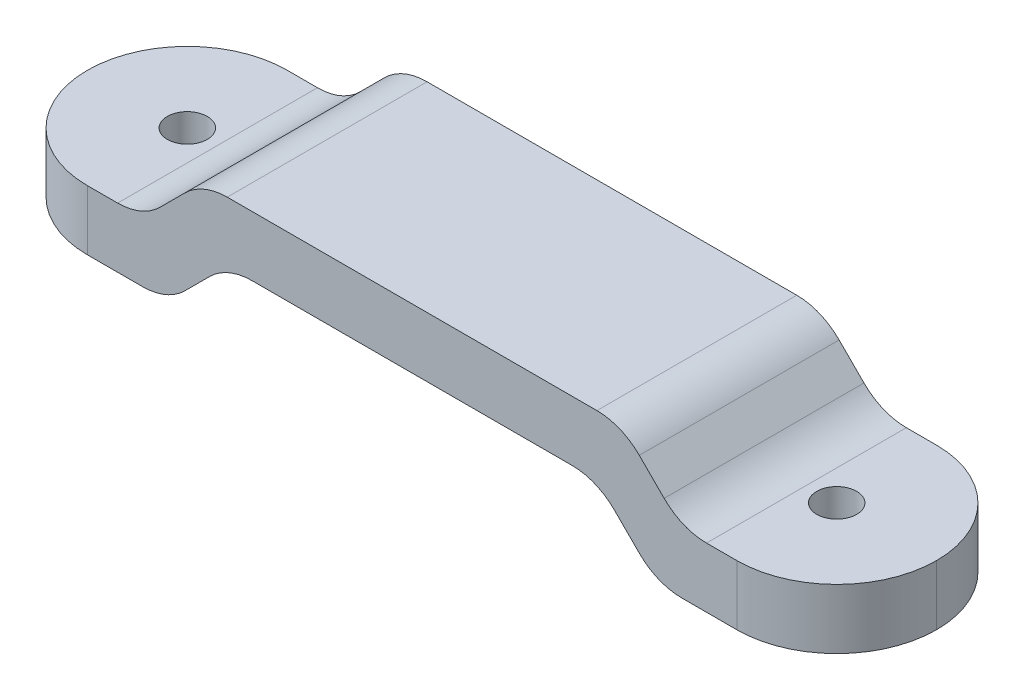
ISO-10303-21;
HEADER;
FILE_DESCRIPTION(('STEP AP214'),'2;1');
FILE_NAME('part.step','',(''),(''),'','','');
FILE_SCHEMA(('AUTOMOTIVE_DESIGN { 1 0 10303 214 1 1 1 1 }'));
ENDSEC;
DATA;
#1=APPLICATION_CONTEXT('core data for automotive mechanical design processes');
#2=APPLICATION_PROTOCOL_DEFINITION('international standard','automotive_design',2000,#1);
#3=PRODUCT_CONTEXT('',#1,'mechanical');
#4=PRODUCT('Part','Part','',(#3));
#5=PRODUCT_RELATED_PRODUCT_CATEGORY('part','',(#4));
#6=PRODUCT_DEFINITION_FORMATION('','',#4);
#7=PRODUCT_DEFINITION_CONTEXT('part definition',#1,'design');
#8=PRODUCT_DEFINITION('design','',#6,#7);
#9=PRODUCT_DEFINITION_SHAPE('','',#8);
#10=(LENGTH_UNIT() NAMED_UNIT(*) SI_UNIT(.MILLI.,.METRE.));
#11=(NAMED_UNIT(*) PLANE_ANGLE_UNIT() SI_UNIT($,.RADIAN.));
#12=(NAMED_UNIT(*) SI_UNIT($,.STERADIAN.) SOLID_ANGLE_UNIT());
#13=UNCERTAINTY_MEASURE_WITH_UNIT(LENGTH_MEASURE(1.E-05),#10,'distance_accuracy_value','');
#14=(GEOMETRIC_REPRESENTATION_CONTEXT(3) GLOBAL_UNCERTAINTY_ASSIGNED_CONTEXT((#13)) GLOBAL_UNIT_ASSIGNED_CONTEXT((#10,
#11,#12)) REPRESENTATION_CONTEXT('',''));
#15=CARTESIAN_POINT('',(0.,0.,0.));
#16=DIRECTION('',(0.,0.,1.));
#17=DIRECTION('',(1.,0.,0.));
#18=AXIS2_PLACEMENT_3D('',#15,#16,#17);
#19=CARTESIAN_POINT('',(-21.25,3.,10.));
#20=DIRECTION('',(0.,-1.,0.));
#21=DIRECTION('',(0.,0.,-1.));
#22=AXIS2_PLACEMENT_3D('',#19,#20,#21);
#23=PLANE('',#22);
#24=CARTESIAN_POINT('',(-16.25,3.,5.));
#25=DIRECTION('',(0.,1.,0.));
#26=DIRECTION('',(0.,0.,1.));
#27=AXIS2_PLACEMENT_3D('',#24,#25,#26);
#28=CIRCLE('',#27,1.);
#29=CARTESIAN_POINT('',(-16.25,3.,6.00000000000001));
#30=VERTEX_POINT('',#29);
#31=EDGE_CURVE('E427',#30,#30,#28,.T.);
#32=ORIENTED_EDGE('',*,*,#31,.F.);
#33=EDGE_LOOP('',(#32));
#34=FACE_BOUND('',#33,.T.);
#35=DIRECTION('',(1.,0.,0.));
#36=VECTOR('',#35,1.);
#37=CARTESIAN_POINT('',(-21.25,3.,0.));
#38=LINE('',#37,#36);
#39=CARTESIAN_POINT('',(-14.7352813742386,3.,0.));
#40=VERTEX_POINT('',#39);
#41=CARTESIAN_POINT('',(-16.25,3.,0.));
#42=VERTEX_POINT('',#41);
#43=EDGE_CURVE('E368',#40,#42,#38,.F.);
#44=ORIENTED_EDGE('',*,*,#43,.T.);
#45=CARTESIAN_POINT('',(-16.25,3.,5.));
#46=DIRECTION('',(0.,-1.,0.));
#47=DIRECTION('',(0.,0.,-1.));
#48=AXIS2_PLACEMENT_3D('',#45,#46,#47);
#49=CIRCLE('',#48,5.);
#50=CARTESIAN_POINT('',(-21.25,3.,5.00000000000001));
#51=VERTEX_POINT('',#50);
#52=EDGE_CURVE('E280',#42,#51,#49,.F.);
#53=ORIENTED_EDGE('',*,*,#52,.T.);
#54=CARTESIAN_POINT('',(-16.25,3.,5.));
#55=DIRECTION('',(0.,-1.,0.));
#56=DIRECTION('',(0.,0.,-1.));
#57=AXIS2_PLACEMENT_3D('',#54,#55,#56);
#58=CIRCLE('',#57,5.);
#59=CARTESIAN_POINT('',(-16.25,3.,10.));
#60=VERTEX_POINT('',#59);
#61=EDGE_CURVE('E278',#51,#60,#58,.F.);
#62=ORIENTED_EDGE('',*,*,#61,.T.);
#63=DIRECTION('',(1.,0.,0.));
#64=VECTOR('',#63,1.);
#65=CARTESIAN_POINT('',(-21.25,3.,10.));
#66=LINE('',#65,#64);
#67=CARTESIAN_POINT('',(-14.7352813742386,3.,10.));
#68=VERTEX_POINT('',#67);
#69=EDGE_CURVE('E335',#68,#60,#66,.F.);
#70=ORIENTED_EDGE('',*,*,#69,.F.);
#71=DIRECTION('',(0.,0.,-1.));
#72=VECTOR('',#71,1.);
#73=CARTESIAN_POINT('',(-14.7352813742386,3.,0.));
#74=LINE('',#73,#72);
#75=EDGE_CURVE('E185',#68,#40,#74,.T.);
#76=ORIENTED_EDGE('',*,*,#75,.T.);
#77=EDGE_LOOP('',(#44,#53,#62,#70,#76));
#78=FACE_BOUND('',#77,.T.);
#79=ADVANCED_FACE('F26',(#34,#78),#23,.F.);
#80=CARTESIAN_POINT('',(-21.25,0.,10.));
#81=DIRECTION('',(0.,-1.,0.));
#82=DIRECTION('',(0.,0.,-1.));
#83=AXIS2_PLACEMENT_3D('',#80,#81,#82);
#84=PLANE('',#83);
#85=CARTESIAN_POINT('',(-16.25,0.,5.));
#86=DIRECTION('',(0.,1.,0.));
#87=DIRECTION('',(0.,0.,1.));
#88=AXIS2_PLACEMENT_3D('',#85,#86,#87);
#89=CIRCLE('',#88,1.);
#90=CARTESIAN_POINT('',(-16.25,0.,6.00000000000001));
#91=VERTEX_POINT('',#90);
#92=EDGE_CURVE('E393',#91,#91,#89,.T.);
#93=ORIENTED_EDGE('',*,*,#92,.T.);
#94=EDGE_LOOP('',(#93));
#95=FACE_BOUND('',#94,.T.);
#96=CARTESIAN_POINT('',(-16.25,0.,5.));
#97=DIRECTION('',(0.,-1.,0.));
#98=DIRECTION('',(0.,0.,-1.));
#99=AXIS2_PLACEMENT_3D('',#96,#97,#98);
#100=CIRCLE('',#99,5.);
#101=CARTESIAN_POINT('',(-16.25,0.,10.));
#102=VERTEX_POINT('',#101);
#103=CARTESIAN_POINT('',(-21.25,0.,5.00000000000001));
#104=VERTEX_POINT('',#103);
#105=EDGE_CURVE('E282',#102,#104,#100,.T.);
#106=ORIENTED_EDGE('',*,*,#105,.T.);
#107=CARTESIAN_POINT('',(-16.25,0.,5.));
#108=DIRECTION('',(0.,-1.,0.));
#109=DIRECTION('',(0.,0.,-1.));
#110=AXIS2_PLACEMENT_3D('',#107,#108,#109);
#111=CIRCLE('',#110,5.);
#112=CARTESIAN_POINT('',(-16.25,0.,0.));
#113=VERTEX_POINT('',#112);
#114=EDGE_CURVE('E284',#104,#113,#111,.T.);
#115=ORIENTED_EDGE('',*,*,#114,.T.);
#116=DIRECTION('',(-1.,0.,0.));
#117=VECTOR('',#116,1.);
#118=CARTESIAN_POINT('',(-21.25,0.,0.));
#119=LINE('',#118,#117);
#120=CARTESIAN_POINT('',(-13.4926406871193,0.,0.));
#121=VERTEX_POINT('',#120);
#122=EDGE_CURVE('E195',#121,#113,#119,.T.);
#123=ORIENTED_EDGE('',*,*,#122,.F.);
#124=DIRECTION('',(0.,0.,-1.));
#125=VECTOR('',#124,1.);
#126=CARTESIAN_POINT('',(-13.4926406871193,0.,10.));
#127=LINE('',#126,#125);
#128=CARTESIAN_POINT('',(-13.4926406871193,0.,10.));
#129=VERTEX_POINT('',#128);
#130=EDGE_CURVE('E215',#121,#129,#127,.F.);
#131=ORIENTED_EDGE('',*,*,#130,.T.);
#132=DIRECTION('',(-1.,0.,0.));
#133=VECTOR('',#132,1.);
#134=CARTESIAN_POINT('',(-21.25,0.,10.));
#135=LINE('',#134,#133);
#136=EDGE_CURVE('E337',#129,#102,#135,.T.);
#137=ORIENTED_EDGE('',*,*,#136,.T.);
#138=EDGE_LOOP('',(#106,#115,#123,#131,#137));
#139=FACE_BOUND('',#138,.T.);
#140=ADVANCED_FACE('F385',(#95,#139),#84,.T.);
#141=CARTESIAN_POINT('',(-12.25,0.,10.));
#142=DIRECTION('',(0.707106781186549,-0.707106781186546,0.));
#143=DIRECTION('',(0.707106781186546,0.707106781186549,0.));
#144=AXIS2_PLACEMENT_3D('',#141,#142,#143);
#145=PLANE('',#144);
#146=DIRECTION('',(-0.707106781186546,-0.707106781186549,0.));
#147=VECTOR('',#146,1.);
#148=CARTESIAN_POINT('',(-12.25,0.,10.));
#149=LINE('',#148,#147);
#150=CARTESIAN_POINT('',(-10.1286796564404,2.12132034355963,10.));
#151=VERTEX_POINT('',#150);
#152=CARTESIAN_POINT('',(-11.3713203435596,0.878679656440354,10.));
#153=VERTEX_POINT('',#152);
#154=EDGE_CURVE('E340',#151,#153,#149,.T.);
#155=ORIENTED_EDGE('',*,*,#154,.T.);
#156=DIRECTION('',(0.,0.,-1.));
#157=VECTOR('',#156,1.);
#158=CARTESIAN_POINT('',(-11.3713203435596,0.878679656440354,10.));
#159=LINE('',#158,#157);
#160=CARTESIAN_POINT('',(-11.3713203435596,0.878679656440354,0.));
#161=VERTEX_POINT('',#160);
#162=EDGE_CURVE('E194',#153,#161,#159,.T.);
#163=ORIENTED_EDGE('',*,*,#162,.T.);
#164=DIRECTION('',(-0.707106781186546,-0.707106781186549,0.));
#165=VECTOR('',#164,1.);
#166=CARTESIAN_POINT('',(-12.25,0.,0.));
#167=LINE('',#166,#165);
#168=CARTESIAN_POINT('',(-10.1286796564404,2.12132034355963,0.));
#169=VERTEX_POINT('',#168);
#170=EDGE_CURVE('E177',#169,#161,#167,.T.);
#171=ORIENTED_EDGE('',*,*,#170,.F.);
#172=DIRECTION('',(0.,0.,-1.));
#173=VECTOR('',#172,1.);
#174=CARTESIAN_POINT('',(-10.1286796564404,2.12132034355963,10.));
#175=LINE('',#174,#173);
#176=EDGE_CURVE('E191',#169,#151,#175,.F.);
#177=ORIENTED_EDGE('',*,*,#176,.T.);
#178=EDGE_LOOP('',(#155,#163,#171,#177));
#179=FACE_BOUND('',#178,.T.);
#180=ADVANCED_FACE('F190',(#179),#145,.T.);
#181=CARTESIAN_POINT('',(-9.25000000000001,3.,10.));
#182=DIRECTION('',(0.,-1.,0.));
#183=DIRECTION('',(1.,0.,0.));
#184=AXIS2_PLACEMENT_3D('',#181,#182,#183);
#185=PLANE('',#184);
#186=DIRECTION('',(-1.,0.,0.));
#187=VECTOR('',#186,1.);
#188=CARTESIAN_POINT('',(-9.25000000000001,3.,10.));
#189=LINE('',#188,#187);
#190=CARTESIAN_POINT('',(8.00735931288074,3.,10.));
#191=VERTEX_POINT('',#190);
#192=CARTESIAN_POINT('',(-8.00735931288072,3.,10.));
#193=VERTEX_POINT('',#192);
#194=EDGE_CURVE('E342',#191,#193,#189,.T.);
#195=ORIENTED_EDGE('',*,*,#194,.T.);
#196=DIRECTION('',(0.,0.,-1.));
#197=VECTOR('',#196,1.);
#198=CARTESIAN_POINT('',(-8.00735931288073,3.,0.));
#199=LINE('',#198,#197);
#200=CARTESIAN_POINT('',(-8.00735931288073,3.,0.));
#201=VERTEX_POINT('',#200);
#202=EDGE_CURVE('E228',#193,#201,#199,.T.);
#203=ORIENTED_EDGE('',*,*,#202,.T.);
#204=DIRECTION('',(-1.,0.,0.));
#205=VECTOR('',#204,1.);
#206=CARTESIAN_POINT('',(-9.25000000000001,3.,0.));
#207=LINE('',#206,#205);
#208=CARTESIAN_POINT('',(8.00735931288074,3.,0.));
#209=VERTEX_POINT('',#208);
#210=EDGE_CURVE('E179',#209,#201,#207,.T.);
#211=ORIENTED_EDGE('',*,*,#210,.F.);
#212=DIRECTION('',(0.,0.,-1.));
#213=VECTOR('',#212,1.);
#214=CARTESIAN_POINT('',(8.00735931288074,3.,10.));
#215=LINE('',#214,#213);
#216=EDGE_CURVE('E226',#209,#191,#215,.F.);
#217=ORIENTED_EDGE('',*,*,#216,.T.);
#218=EDGE_LOOP('',(#195,#203,#211,#217));
#219=FACE_BOUND('',#218,.T.);
#220=ADVANCED_FACE('F491',(#219),#185,.T.);
#221=CARTESIAN_POINT('',(12.25,0.,10.));
#222=DIRECTION('',(-0.707106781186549,-0.707106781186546,0.));
#223=DIRECTION('',(0.707106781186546,-0.707106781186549,0.));
#224=AXIS2_PLACEMENT_3D('',#221,#222,#223);
#225=PLANE('',#224);
#226=DIRECTION('',(-0.707106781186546,0.707106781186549,0.));
#227=VECTOR('',#226,1.);
#228=CARTESIAN_POINT('',(12.25,0.,10.));
#229=LINE('',#228,#227);
#230=CARTESIAN_POINT('',(11.3713203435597,0.878679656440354,10.));
#231=VERTEX_POINT('',#230);
#232=CARTESIAN_POINT('',(10.1286796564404,2.12132034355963,10.));
#233=VERTEX_POINT('',#232);
#234=EDGE_CURVE('E305',#231,#233,#229,.T.);
#235=ORIENTED_EDGE('',*,*,#234,.T.);
#236=DIRECTION('',(0.,0.,-1.));
#237=VECTOR('',#236,1.);
#238=CARTESIAN_POINT('',(10.1286796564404,2.12132034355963,0.));
#239=LINE('',#238,#237);
#240=CARTESIAN_POINT('',(10.1286796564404,2.12132034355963,0.));
#241=VERTEX_POINT('',#240);
#242=EDGE_CURVE('E232',#233,#241,#239,.T.);
#243=ORIENTED_EDGE('',*,*,#242,.T.);
#244=DIRECTION('',(-0.707106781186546,0.707106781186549,0.));
#245=VECTOR('',#244,1.);
#246=CARTESIAN_POINT('',(12.25,0.,0.));
#247=LINE('',#246,#245);
#248=CARTESIAN_POINT('',(11.3713203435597,0.878679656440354,0.));
#249=VERTEX_POINT('',#248);
#250=EDGE_CURVE('E326',#249,#241,#247,.T.);
#251=ORIENTED_EDGE('',*,*,#250,.F.);
#252=DIRECTION('',(0.,0.,-1.));
#253=VECTOR('',#252,1.);
#254=CARTESIAN_POINT('',(11.3713203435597,0.878679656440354,10.));
#255=LINE('',#254,#253);
#256=EDGE_CURVE('E230',#249,#231,#255,.F.);
#257=ORIENTED_EDGE('',*,*,#256,.T.);
#258=EDGE_LOOP('',(#235,#243,#251,#257));
#259=FACE_BOUND('',#258,.T.);
#260=ADVANCED_FACE('F402',(#259),#225,.T.);
#261=CARTESIAN_POINT('',(21.25,0.,9.99999999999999));
#262=DIRECTION('',(0.,-1.,0.));
#263=DIRECTION('',(1.,0.,0.));
#264=AXIS2_PLACEMENT_3D('',#261,#262,#263);
#265=PLANE('',#264);
#266=CARTESIAN_POINT('',(16.25,0.,4.99999999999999));
#267=DIRECTION('',(0.,1.,0.));
#268=DIRECTION('',(0.,0.,-1.));
#269=AXIS2_PLACEMENT_3D('',#266,#267,#268);
#270=CIRCLE('',#269,0.999999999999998);
#271=CARTESIAN_POINT('',(16.25,0.,4.));
#272=VERTEX_POINT('',#271);
#273=EDGE_CURVE('E429',#272,#272,#270,.T.);
#274=ORIENTED_EDGE('',*,*,#273,.T.);
#275=EDGE_LOOP('',(#274));
#276=FACE_BOUND('',#275,.T.);
#277=DIRECTION('',(-1.,0.,0.));
#278=VECTOR('',#277,1.);
#279=CARTESIAN_POINT('',(21.25,0.,0.));
#280=LINE('',#279,#278);
#281=CARTESIAN_POINT('',(16.25,0.,0.));
#282=VERTEX_POINT('',#281);
#283=CARTESIAN_POINT('',(13.4926406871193,0.,0.));
#284=VERTEX_POINT('',#283);
#285=EDGE_CURVE('E321',#282,#284,#280,.T.);
#286=ORIENTED_EDGE('',*,*,#285,.F.);
#287=CARTESIAN_POINT('',(16.25,0.,5.));
#288=DIRECTION('',(0.,-1.,0.));
#289=DIRECTION('',(1.,0.,0.));
#290=AXIS2_PLACEMENT_3D('',#287,#288,#289);
#291=CIRCLE('',#290,5.);
#292=CARTESIAN_POINT('',(21.25,0.,5.00000000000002));
#293=VERTEX_POINT('',#292);
#294=EDGE_CURVE('E46',#282,#293,#291,.T.);
#295=ORIENTED_EDGE('',*,*,#294,.T.);
#296=CARTESIAN_POINT('',(16.25,0.,5.));
#297=DIRECTION('',(0.,-1.,0.));
#298=DIRECTION('',(1.,0.,0.));
#299=AXIS2_PLACEMENT_3D('',#296,#297,#298);
#300=CIRCLE('',#299,5.);
#301=CARTESIAN_POINT('',(16.25,0.,10.));
#302=VERTEX_POINT('',#301);
#303=EDGE_CURVE('E290',#293,#302,#300,.T.);
#304=ORIENTED_EDGE('',*,*,#303,.T.);
#305=DIRECTION('',(-1.,0.,0.));
#306=VECTOR('',#305,1.);
#307=CARTESIAN_POINT('',(21.25,0.,9.99999999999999));
#308=LINE('',#307,#306);
#309=CARTESIAN_POINT('',(13.4926406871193,0.,10.));
#310=VERTEX_POINT('',#309);
#311=EDGE_CURVE('E294',#302,#310,#308,.T.);
#312=ORIENTED_EDGE('',*,*,#311,.T.);
#313=DIRECTION('',(0.,0.,-1.));
#314=VECTOR('',#313,1.);
#315=CARTESIAN_POINT('',(13.4926406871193,0.,10.));
#316=LINE('',#315,#314);
#317=EDGE_CURVE('E235',#310,#284,#316,.T.);
#318=ORIENTED_EDGE('',*,*,#317,.T.);
#319=EDGE_LOOP('',(#286,#295,#304,#312,#318));
#320=FACE_BOUND('',#319,.T.);
#321=ADVANCED_FACE('F293',(#276,#320),#265,.T.);
#322=CARTESIAN_POINT('',(21.25,3.,9.99999999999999));
#323=DIRECTION('',(0.,-1.,0.));
#324=DIRECTION('',(1.,0.,0.));
#325=AXIS2_PLACEMENT_3D('',#322,#323,#324);
#326=PLANE('',#325);
#327=CARTESIAN_POINT('',(16.25,3.,4.99999999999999));
#328=DIRECTION('',(0.,1.,0.));
#329=DIRECTION('',(0.,0.,-1.));
#330=AXIS2_PLACEMENT_3D('',#327,#328,#329);
#331=CIRCLE('',#330,0.999999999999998);
#332=CARTESIAN_POINT('',(16.25,3.,4.));
#333=VERTEX_POINT('',#332);
#334=EDGE_CURVE('E433',#333,#333,#331,.T.);
#335=ORIENTED_EDGE('',*,*,#334,.F.);
#336=EDGE_LOOP('',(#335));
#337=FACE_BOUND('',#336,.T.);
#338=CARTESIAN_POINT('',(16.25,3.,5.));
#339=DIRECTION('',(0.,-1.,0.));
#340=DIRECTION('',(1.,0.,0.));
#341=AXIS2_PLACEMENT_3D('',#338,#339,#340);
#342=CIRCLE('',#341,5.);
#343=CARTESIAN_POINT('',(16.25,3.,10.));
#344=VERTEX_POINT('',#343);
#345=CARTESIAN_POINT('',(21.25,3.,5.00000000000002));
#346=VERTEX_POINT('',#345);
#347=EDGE_CURVE('E33',#344,#346,#342,.F.);
#348=ORIENTED_EDGE('',*,*,#347,.T.);
#349=CARTESIAN_POINT('',(16.25,3.,5.));
#350=DIRECTION('',(0.,-1.,0.));
#351=DIRECTION('',(1.,0.,0.));
#352=AXIS2_PLACEMENT_3D('',#349,#350,#351);
#353=CIRCLE('',#352,5.);
#354=CARTESIAN_POINT('',(16.25,3.,0.));
#355=VERTEX_POINT('',#354);
#356=EDGE_CURVE('E11',#346,#355,#353,.F.);
#357=ORIENTED_EDGE('',*,*,#356,.T.);
#358=DIRECTION('',(-1.,0.,0.));
#359=VECTOR('',#358,1.);
#360=CARTESIAN_POINT('',(21.25,3.,0.));
#361=LINE('',#360,#359);
#362=CARTESIAN_POINT('',(14.7352813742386,3.,0.));
#363=VERTEX_POINT('',#362);
#364=EDGE_CURVE('E317',#355,#363,#361,.T.);
#365=ORIENTED_EDGE('',*,*,#364,.T.);
#366=DIRECTION('',(0.,0.,-1.));
#367=VECTOR('',#366,1.);
#368=CARTESIAN_POINT('',(14.7352813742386,3.,10.));
#369=LINE('',#368,#367);
#370=CARTESIAN_POINT('',(14.7352813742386,3.,10.));
#371=VERTEX_POINT('',#370);
#372=EDGE_CURVE('E248',#363,#371,#369,.F.);
#373=ORIENTED_EDGE('',*,*,#372,.T.);
#374=DIRECTION('',(-1.,0.,0.));
#375=VECTOR('',#374,1.);
#376=CARTESIAN_POINT('',(21.25,3.,9.99999999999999));
#377=LINE('',#376,#375);
#378=EDGE_CURVE('E304',#344,#371,#377,.T.);
#379=ORIENTED_EDGE('',*,*,#378,.F.);
#380=EDGE_LOOP('',(#348,#357,#365,#373,#379));
#381=FACE_BOUND('',#380,.T.);
#382=ADVANCED_FACE('F316',(#337,#381),#326,.F.);
#383=CARTESIAN_POINT('',(14.3713203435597,2.12132034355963,10.));
#384=DIRECTION('',(-0.707106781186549,-0.707106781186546,0.));
#385=DIRECTION('',(0.707106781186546,-0.707106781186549,0.));
#386=AXIS2_PLACEMENT_3D('',#383,#384,#385);
#387=PLANE('',#386);
#388=DIRECTION('',(-0.707106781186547,0.707106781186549,0.));
#389=VECTOR('',#388,1.);
#390=CARTESIAN_POINT('',(14.3713203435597,2.12132034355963,0.));
#391=LINE('',#390,#389);
#392=CARTESIAN_POINT('',(12.6139610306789,3.87867965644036,0.));
#393=VERTEX_POINT('',#392);
#394=CARTESIAN_POINT('',(11.3713203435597,5.12132034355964,0.));
#395=VERTEX_POINT('',#394);
#396=EDGE_CURVE('E320',#393,#395,#391,.T.);
#397=ORIENTED_EDGE('',*,*,#396,.T.);
#398=DIRECTION('',(0.,0.,-1.));
#399=VECTOR('',#398,1.);
#400=CARTESIAN_POINT('',(11.3713203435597,5.12132034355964,10.));
#401=LINE('',#400,#399);
#402=CARTESIAN_POINT('',(11.3713203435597,5.12132034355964,10.));
#403=VERTEX_POINT('',#402);
#404=EDGE_CURVE('E246',#395,#403,#401,.F.);
#405=ORIENTED_EDGE('',*,*,#404,.T.);
#406=DIRECTION('',(-0.707106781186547,0.707106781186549,0.));
#407=VECTOR('',#406,1.);
#408=CARTESIAN_POINT('',(14.3713203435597,2.12132034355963,10.));
#409=LINE('',#408,#407);
#410=CARTESIAN_POINT('',(12.6139610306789,3.87867965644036,10.));
#411=VERTEX_POINT('',#410);
#412=EDGE_CURVE('E348',#411,#403,#409,.T.);
#413=ORIENTED_EDGE('',*,*,#412,.F.);
#414=DIRECTION('',(0.,0.,-1.));
#415=VECTOR('',#414,1.);
#416=CARTESIAN_POINT('',(12.6139610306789,3.87867965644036,0.));
#417=LINE('',#416,#415);
#418=EDGE_CURVE('E243',#411,#393,#417,.T.);
#419=ORIENTED_EDGE('',*,*,#418,.T.);
#420=EDGE_LOOP('',(#397,#405,#413,#419));
#421=FACE_BOUND('',#420,.T.);
#422=ADVANCED_FACE('F470',(#421),#387,.F.);
#423=CARTESIAN_POINT('',(-9.25000000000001,6.,10.));
#424=DIRECTION('',(0.,-1.,0.));
#425=DIRECTION('',(1.,0.,0.));
#426=AXIS2_PLACEMENT_3D('',#423,#424,#425);
#427=PLANE('',#426);
#428=DIRECTION('',(-1.,0.,0.));
#429=VECTOR('',#428,1.);
#430=CARTESIAN_POINT('',(-9.25000000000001,6.,10.));
#431=LINE('',#430,#429);
#432=CARTESIAN_POINT('',(9.25000000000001,6.,10.));
#433=VERTEX_POINT('',#432);
#434=CARTESIAN_POINT('',(-9.25000000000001,6.,10.));
#435=VERTEX_POINT('',#434);
#436=EDGE_CURVE('E204',#433,#435,#431,.T.);
#437=ORIENTED_EDGE('',*,*,#436,.F.);
#438=DIRECTION('',(0.,0.,-1.));
#439=VECTOR('',#438,1.);
#440=CARTESIAN_POINT('',(9.25000000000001,6.,10.));
#441=LINE('',#440,#439);
#442=CARTESIAN_POINT('',(9.25000000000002,6.,0.));
#443=VERTEX_POINT('',#442);
#444=EDGE_CURVE('E240',#433,#443,#441,.T.);
#445=ORIENTED_EDGE('',*,*,#444,.T.);
#446=DIRECTION('',(-1.,0.,0.));
#447=VECTOR('',#446,1.);
#448=CARTESIAN_POINT('',(-9.25000000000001,6.,0.));
#449=LINE('',#448,#447);
#450=CARTESIAN_POINT('',(-9.25000000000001,6.,0.));
#451=VERTEX_POINT('',#450);
#452=EDGE_CURVE('E324',#443,#451,#449,.T.);
#453=ORIENTED_EDGE('',*,*,#452,.T.);
#454=DIRECTION('',(0.,0.,-1.));
#455=VECTOR('',#454,1.);
#456=CARTESIAN_POINT('',(-9.25000000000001,6.,10.));
#457=LINE('',#456,#455);
#458=EDGE_CURVE('E238',#451,#435,#457,.F.);
#459=ORIENTED_EDGE('',*,*,#458,.T.);
#460=EDGE_LOOP('',(#437,#445,#453,#459));
#461=FACE_BOUND('',#460,.T.);
#462=ADVANCED_FACE('F472',(#461),#427,.F.);
#463=CARTESIAN_POINT('',(-14.3713203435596,2.12132034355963,10.));
#464=DIRECTION('',(0.707106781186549,-0.707106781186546,0.));
#465=DIRECTION('',(0.707106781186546,0.707106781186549,0.));
#466=AXIS2_PLACEMENT_3D('',#463,#464,#465);
#467=PLANE('',#466);
#468=DIRECTION('',(-0.707106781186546,-0.707106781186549,0.));
#469=VECTOR('',#468,1.);
#470=CARTESIAN_POINT('',(-14.3713203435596,2.12132034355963,10.));
#471=LINE('',#470,#469);
#472=CARTESIAN_POINT('',(-11.3713203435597,5.12132034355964,10.));
#473=VERTEX_POINT('',#472);
#474=CARTESIAN_POINT('',(-12.6139610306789,3.87867965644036,10.));
#475=VERTEX_POINT('',#474);
#476=EDGE_CURVE('E199',#473,#475,#471,.T.);
#477=ORIENTED_EDGE('',*,*,#476,.F.);
#478=DIRECTION('',(0.,0.,-1.));
#479=VECTOR('',#478,1.);
#480=CARTESIAN_POINT('',(-11.3713203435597,5.12132034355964,10.));
#481=LINE('',#480,#479);
#482=CARTESIAN_POINT('',(-11.3713203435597,5.12132034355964,0.));
#483=VERTEX_POINT('',#482);
#484=EDGE_CURVE('E253',#473,#483,#481,.T.);
#485=ORIENTED_EDGE('',*,*,#484,.T.);
#486=DIRECTION('',(-0.707106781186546,-0.707106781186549,0.));
#487=VECTOR('',#486,1.);
#488=CARTESIAN_POINT('',(-14.3713203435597,2.12132034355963,0.));
#489=LINE('',#488,#487);
#490=CARTESIAN_POINT('',(-12.6139610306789,3.87867965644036,0.));
#491=VERTEX_POINT('',#490);
#492=EDGE_CURVE('E332',#483,#491,#489,.T.);
#493=ORIENTED_EDGE('',*,*,#492,.T.);
#494=DIRECTION('',(0.,0.,-1.));
#495=VECTOR('',#494,1.);
#496=CARTESIAN_POINT('',(-12.6139610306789,3.87867965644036,10.));
#497=LINE('',#496,#495);
#498=EDGE_CURVE('E251',#491,#475,#497,.F.);
#499=ORIENTED_EDGE('',*,*,#498,.T.);
#500=EDGE_LOOP('',(#477,#485,#493,#499));
#501=FACE_BOUND('',#500,.T.);
#502=ADVANCED_FACE('F363',(#501),#467,.F.);
#503=CARTESIAN_POINT('',(-21.25,3.,10.));
#504=DIRECTION('',(0.,0.,1.));
#505=DIRECTION('',(1.,0.,0.));
#506=AXIS2_PLACEMENT_3D('',#503,#504,#505);
#507=PLANE('',#506);
#508=ORIENTED_EDGE('',*,*,#69,.T.);
#509=DIRECTION('',(0.,1.,0.));
#510=VECTOR('',#509,1.);
#511=CARTESIAN_POINT('',(-16.25,3.,10.));
#512=LINE('',#511,#510);
#513=EDGE_CURVE('E288',#60,#102,#512,.F.);
#514=ORIENTED_EDGE('',*,*,#513,.T.);
#515=ORIENTED_EDGE('',*,*,#136,.F.);
#516=CARTESIAN_POINT('',(-13.4926406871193,3.,10.));
#517=DIRECTION('',(0.,0.,1.));
#518=DIRECTION('',(1.,0.,0.));
#519=AXIS2_PLACEMENT_3D('',#516,#517,#518);
#520=CIRCLE('',#519,3.);
#521=EDGE_CURVE('E224',#129,#153,#520,.T.);
#522=ORIENTED_EDGE('',*,*,#521,.T.);
#523=ORIENTED_EDGE('',*,*,#154,.F.);
#524=CARTESIAN_POINT('',(-8.00735931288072,0.,10.));
#525=DIRECTION('',(0.,0.,1.));
#526=DIRECTION('',(1.,0.,0.));
#527=AXIS2_PLACEMENT_3D('',#524,#525,#526);
#528=CIRCLE('',#527,3.);
#529=EDGE_CURVE('E184',#151,#193,#528,.F.);
#530=ORIENTED_EDGE('',*,*,#529,.T.);
#531=ORIENTED_EDGE('',*,*,#194,.F.);
#532=CARTESIAN_POINT('',(8.00735931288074,0.,10.));
#533=DIRECTION('',(0.,0.,1.));
#534=DIRECTION('',(1.,0.,0.));
#535=AXIS2_PLACEMENT_3D('',#532,#533,#534);
#536=CIRCLE('',#535,3.);
#537=EDGE_CURVE('E261',#191,#233,#536,.F.);
#538=ORIENTED_EDGE('',*,*,#537,.T.);
#539=ORIENTED_EDGE('',*,*,#234,.F.);
#540=CARTESIAN_POINT('',(13.4926406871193,3.,10.));
#541=DIRECTION('',(0.,0.,1.));
#542=DIRECTION('',(1.,0.,0.));
#543=AXIS2_PLACEMENT_3D('',#540,#541,#542);
#544=CIRCLE('',#543,3.);
#545=EDGE_CURVE('E221',#231,#310,#544,.T.);
#546=ORIENTED_EDGE('',*,*,#545,.T.);
#547=ORIENTED_EDGE('',*,*,#311,.F.);
#548=DIRECTION('',(0.,-1.,0.));
#549=VECTOR('',#548,1.);
#550=CARTESIAN_POINT('',(16.25,3.,10.));
#551=LINE('',#550,#549);
#552=EDGE_CURVE('E286',#302,#344,#551,.F.);
#553=ORIENTED_EDGE('',*,*,#552,.T.);
#554=ORIENTED_EDGE('',*,*,#378,.T.);
#555=CARTESIAN_POINT('',(14.7352813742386,6.,10.));
#556=DIRECTION('',(0.,0.,1.));
#557=DIRECTION('',(1.,0.,0.));
#558=AXIS2_PLACEMENT_3D('',#555,#556,#557);
#559=CIRCLE('',#558,3.);
#560=EDGE_CURVE('E266',#371,#411,#559,.F.);
#561=ORIENTED_EDGE('',*,*,#560,.T.);
#562=ORIENTED_EDGE('',*,*,#412,.T.);
#563=CARTESIAN_POINT('',(9.25000000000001,3.,10.));
#564=DIRECTION('',(0.,0.,1.));
#565=DIRECTION('',(1.,0.,0.));
#566=AXIS2_PLACEMENT_3D('',#563,#564,#565);
#567=CIRCLE('',#566,3.);
#568=EDGE_CURVE('E219',#403,#433,#567,.T.);
#569=ORIENTED_EDGE('',*,*,#568,.T.);
#570=ORIENTED_EDGE('',*,*,#436,.T.);
#571=CARTESIAN_POINT('',(-9.25000000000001,3.,10.));
#572=DIRECTION('',(0.,0.,1.));
#573=DIRECTION('',(1.,0.,0.));
#574=AXIS2_PLACEMENT_3D('',#571,#572,#573);
#575=CIRCLE('',#574,3.);
#576=EDGE_CURVE('E217',#435,#473,#575,.T.);
#577=ORIENTED_EDGE('',*,*,#576,.T.);
#578=ORIENTED_EDGE('',*,*,#476,.T.);
#579=CARTESIAN_POINT('',(-14.7352813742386,5.99999999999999,10.));
#580=DIRECTION('',(0.,0.,1.));
#581=DIRECTION('',(1.,0.,0.));
#582=AXIS2_PLACEMENT_3D('',#579,#580,#581);
#583=CIRCLE('',#582,3.);
#584=EDGE_CURVE('E270',#475,#68,#583,.F.);
#585=ORIENTED_EDGE('',*,*,#584,.T.);
#586=EDGE_LOOP('',(#508,#514,#515,#522,#523,#530,#531,#538,#539,#546,#547,#553,#554,#561,#562,
#569,#570,#577,#578,#585));
#587=FACE_BOUND('',#586,.T.);
#588=ADVANCED_FACE('F300',(#587),#507,.T.);
#589=CARTESIAN_POINT('',(-21.25,3.,0.));
#590=DIRECTION('',(0.,0.,1.));
#591=DIRECTION('',(1.,0.,0.));
#592=AXIS2_PLACEMENT_3D('',#589,#590,#591);
#593=PLANE('',#592);
#594=ORIENTED_EDGE('',*,*,#122,.T.);
#595=DIRECTION('',(0.,1.,0.));
#596=VECTOR('',#595,1.);
#597=CARTESIAN_POINT('',(-16.25,3.,0.));
#598=LINE('',#597,#596);
#599=EDGE_CURVE('E275',#113,#42,#598,.T.);
#600=ORIENTED_EDGE('',*,*,#599,.T.);
#601=ORIENTED_EDGE('',*,*,#43,.F.);
#602=CARTESIAN_POINT('',(-14.7352813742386,5.99999999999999,0.));
#603=DIRECTION('',(0.,0.,1.));
#604=DIRECTION('',(1.,0.,0.));
#605=AXIS2_PLACEMENT_3D('',#602,#603,#604);
#606=CIRCLE('',#605,3.);
#607=EDGE_CURVE('E268',#40,#491,#606,.T.);
#608=ORIENTED_EDGE('',*,*,#607,.T.);
#609=ORIENTED_EDGE('',*,*,#492,.F.);
#610=CARTESIAN_POINT('',(-9.25000000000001,3.,0.));
#611=DIRECTION('',(0.,0.,1.));
#612=DIRECTION('',(1.,0.,0.));
#613=AXIS2_PLACEMENT_3D('',#610,#611,#612);
#614=CIRCLE('',#613,3.);
#615=EDGE_CURVE('E201',#483,#451,#614,.F.);
#616=ORIENTED_EDGE('',*,*,#615,.T.);
#617=ORIENTED_EDGE('',*,*,#452,.F.);
#618=CARTESIAN_POINT('',(9.25000000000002,3.,0.));
#619=DIRECTION('',(0.,0.,1.));
#620=DIRECTION('',(1.,0.,0.));
#621=AXIS2_PLACEMENT_3D('',#618,#619,#620);
#622=CIRCLE('',#621,3.);
#623=EDGE_CURVE('E209',#443,#395,#622,.F.);
#624=ORIENTED_EDGE('',*,*,#623,.T.);
#625=ORIENTED_EDGE('',*,*,#396,.F.);
#626=CARTESIAN_POINT('',(14.7352813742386,6.,0.));
#627=DIRECTION('',(0.,0.,1.));
#628=DIRECTION('',(1.,0.,0.));
#629=AXIS2_PLACEMENT_3D('',#626,#627,#628);
#630=CIRCLE('',#629,3.);
#631=EDGE_CURVE('E263',#393,#363,#630,.T.);
#632=ORIENTED_EDGE('',*,*,#631,.T.);
#633=ORIENTED_EDGE('',*,*,#364,.F.);
#634=DIRECTION('',(0.,-1.,0.));
#635=VECTOR('',#634,1.);
#636=CARTESIAN_POINT('',(16.25,0.,0.));
#637=LINE('',#636,#635);
#638=EDGE_CURVE('E272',#355,#282,#637,.T.);
#639=ORIENTED_EDGE('',*,*,#638,.T.);
#640=ORIENTED_EDGE('',*,*,#285,.T.);
#641=CARTESIAN_POINT('',(13.4926406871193,3.,0.));
#642=DIRECTION('',(0.,0.,1.));
#643=DIRECTION('',(1.,0.,0.));
#644=AXIS2_PLACEMENT_3D('',#641,#642,#643);
#645=CIRCLE('',#644,3.);
#646=EDGE_CURVE('E211',#284,#249,#645,.F.);
#647=ORIENTED_EDGE('',*,*,#646,.T.);
#648=ORIENTED_EDGE('',*,*,#250,.T.);
#649=CARTESIAN_POINT('',(8.00735931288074,0.,0.));
#650=DIRECTION('',(0.,0.,1.));
#651=DIRECTION('',(1.,0.,0.));
#652=AXIS2_PLACEMENT_3D('',#649,#650,#651);
#653=CIRCLE('',#652,3.);
#654=EDGE_CURVE('E259',#241,#209,#653,.T.);
#655=ORIENTED_EDGE('',*,*,#654,.T.);
#656=ORIENTED_EDGE('',*,*,#210,.T.);
#657=CARTESIAN_POINT('',(-8.00735931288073,0.,0.));
#658=DIRECTION('',(0.,0.,1.));
#659=DIRECTION('',(1.,0.,0.));
#660=AXIS2_PLACEMENT_3D('',#657,#658,#659);
#661=CIRCLE('',#660,3.);
#662=EDGE_CURVE('E173',#201,#169,#661,.T.);
#663=ORIENTED_EDGE('',*,*,#662,.T.);
#664=ORIENTED_EDGE('',*,*,#170,.T.);
#665=CARTESIAN_POINT('',(-13.4926406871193,3.,0.));
#666=DIRECTION('',(0.,0.,1.));
#667=DIRECTION('',(1.,0.,0.));
#668=AXIS2_PLACEMENT_3D('',#665,#666,#667);
#669=CIRCLE('',#668,3.);
#670=EDGE_CURVE('E213',#161,#121,#669,.F.);
#671=ORIENTED_EDGE('',*,*,#670,.T.);
#672=EDGE_LOOP('',(#594,#600,#601,#608,#609,#616,#617,#624,#625,#632,#633,#639,#640,#647,#648,
#655,#656,#663,#664,#671));
#673=FACE_BOUND('',#672,.T.);
#674=ADVANCED_FACE('F176',(#673),#593,.F.);
#675=CARTESIAN_POINT('',(-13.4926406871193,3.,10.));
#676=DIRECTION('',(0.,0.,-1.));
#677=DIRECTION('',(-1.,0.,0.));
#678=AXIS2_PLACEMENT_3D('',#675,#676,#677);
#679=CYLINDRICAL_SURFACE('',#678,3.);
#680=ORIENTED_EDGE('',*,*,#521,.F.);
#681=ORIENTED_EDGE('',*,*,#130,.F.);
#682=ORIENTED_EDGE('',*,*,#670,.F.);
#683=ORIENTED_EDGE('',*,*,#162,.F.);
#684=EDGE_LOOP('',(#680,#681,#682,#683));
#685=FACE_BOUND('',#684,.T.);
#686=ADVANCED_FACE('F390',(#685),#679,.T.);
#687=CARTESIAN_POINT('',(-8.00735931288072,0.,10.));
#688=DIRECTION('',(0.,0.,1.));
#689=DIRECTION('',(1.,0.,0.));
#690=AXIS2_PLACEMENT_3D('',#687,#688,#689);
#691=CYLINDRICAL_SURFACE('',#690,3.);
#692=ORIENTED_EDGE('',*,*,#529,.F.);
#693=ORIENTED_EDGE('',*,*,#176,.F.);
#694=ORIENTED_EDGE('',*,*,#662,.F.);
#695=ORIENTED_EDGE('',*,*,#202,.F.);
#696=EDGE_LOOP('',(#692,#693,#694,#695));
#697=FACE_BOUND('',#696,.T.);
#698=ADVANCED_FACE('F198',(#697),#691,.F.);
#699=CARTESIAN_POINT('',(8.00735931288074,0.,10.));
#700=DIRECTION('',(0.,0.,1.));
#701=DIRECTION('',(1.,0.,0.));
#702=AXIS2_PLACEMENT_3D('',#699,#700,#701);
#703=CYLINDRICAL_SURFACE('',#702,3.);
#704=ORIENTED_EDGE('',*,*,#537,.F.);
#705=ORIENTED_EDGE('',*,*,#216,.F.);
#706=ORIENTED_EDGE('',*,*,#654,.F.);
#707=ORIENTED_EDGE('',*,*,#242,.F.);
#708=EDGE_LOOP('',(#704,#705,#706,#707));
#709=FACE_BOUND('',#708,.T.);
#710=ADVANCED_FACE('F408',(#709),#703,.F.);
#711=CARTESIAN_POINT('',(13.4926406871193,3.,10.));
#712=DIRECTION('',(0.,0.,-1.));
#713=DIRECTION('',(-1.,0.,0.));
#714=AXIS2_PLACEMENT_3D('',#711,#712,#713);
#715=CYLINDRICAL_SURFACE('',#714,3.);
#716=ORIENTED_EDGE('',*,*,#545,.F.);
#717=ORIENTED_EDGE('',*,*,#256,.F.);
#718=ORIENTED_EDGE('',*,*,#646,.F.);
#719=ORIENTED_EDGE('',*,*,#317,.F.);
#720=EDGE_LOOP('',(#716,#717,#718,#719));
#721=FACE_BOUND('',#720,.T.);
#722=ADVANCED_FACE('F405',(#721),#715,.T.);
#723=CARTESIAN_POINT('',(9.25000000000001,3.,10.));
#724=DIRECTION('',(0.,0.,-1.));
#725=DIRECTION('',(-1.,0.,0.));
#726=AXIS2_PLACEMENT_3D('',#723,#724,#725);
#727=CYLINDRICAL_SURFACE('',#726,3.);
#728=ORIENTED_EDGE('',*,*,#568,.F.);
#729=ORIENTED_EDGE('',*,*,#404,.F.);
#730=ORIENTED_EDGE('',*,*,#623,.F.);
#731=ORIENTED_EDGE('',*,*,#444,.F.);
#732=EDGE_LOOP('',(#728,#729,#730,#731));
#733=FACE_BOUND('',#732,.T.);
#734=ADVANCED_FACE('F407',(#733),#727,.T.);
#735=CARTESIAN_POINT('',(14.7352813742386,6.,10.));
#736=DIRECTION('',(0.,0.,1.));
#737=DIRECTION('',(1.,0.,0.));
#738=AXIS2_PLACEMENT_3D('',#735,#736,#737);
#739=CYLINDRICAL_SURFACE('',#738,3.);
#740=ORIENTED_EDGE('',*,*,#560,.F.);
#741=ORIENTED_EDGE('',*,*,#372,.F.);
#742=ORIENTED_EDGE('',*,*,#631,.F.);
#743=ORIENTED_EDGE('',*,*,#418,.F.);
#744=EDGE_LOOP('',(#740,#741,#742,#743));
#745=FACE_BOUND('',#744,.T.);
#746=ADVANCED_FACE('F414',(#745),#739,.F.);
#747=CARTESIAN_POINT('',(-9.25000000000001,3.,10.));
#748=DIRECTION('',(0.,0.,-1.));
#749=DIRECTION('',(-1.,0.,0.));
#750=AXIS2_PLACEMENT_3D('',#747,#748,#749);
#751=CYLINDRICAL_SURFACE('',#750,3.);
#752=ORIENTED_EDGE('',*,*,#576,.F.);
#753=ORIENTED_EDGE('',*,*,#458,.F.);
#754=ORIENTED_EDGE('',*,*,#615,.F.);
#755=ORIENTED_EDGE('',*,*,#484,.F.);
#756=EDGE_LOOP('',(#752,#753,#754,#755));
#757=FACE_BOUND('',#756,.T.);
#758=ADVANCED_FACE('F360',(#757),#751,.T.);
#759=CARTESIAN_POINT('',(-14.7352813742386,5.99999999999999,10.));
#760=DIRECTION('',(0.,0.,1.));
#761=DIRECTION('',(1.,0.,0.));
#762=AXIS2_PLACEMENT_3D('',#759,#760,#761);
#763=CYLINDRICAL_SURFACE('',#762,3.);
#764=ORIENTED_EDGE('',*,*,#584,.F.);
#765=ORIENTED_EDGE('',*,*,#498,.F.);
#766=ORIENTED_EDGE('',*,*,#607,.F.);
#767=ORIENTED_EDGE('',*,*,#75,.F.);
#768=EDGE_LOOP('',(#764,#765,#766,#767));
#769=FACE_BOUND('',#768,.T.);
#770=ADVANCED_FACE('F372',(#769),#763,.F.);
#771=CARTESIAN_POINT('',(-16.25,0.,5.));
#772=DIRECTION('',(0.,1.,0.));
#773=DIRECTION('',(0.,0.,1.));
#774=AXIS2_PLACEMENT_3D('',#771,#772,#773);
#775=CYLINDRICAL_SURFACE('',#774,1.);
#776=ORIENTED_EDGE('',*,*,#92,.F.);
#777=EDGE_LOOP('',(#776));
#778=FACE_BOUND('',#777,.T.);
#779=ORIENTED_EDGE('',*,*,#31,.T.);
#780=EDGE_LOOP('',(#779));
#781=FACE_BOUND('',#780,.T.);
#782=ADVANCED_FACE('F453',(#778,#781),#775,.F.);
#783=CARTESIAN_POINT('',(16.25,0.,4.99999999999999));
#784=DIRECTION('',(0.,1.,0.));
#785=DIRECTION('',(0.,0.,1.));
#786=AXIS2_PLACEMENT_3D('',#783,#784,#785);
#787=CYLINDRICAL_SURFACE('',#786,0.999999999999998);
#788=ORIENTED_EDGE('',*,*,#273,.F.);
#789=EDGE_LOOP('',(#788));
#790=FACE_BOUND('',#789,.T.);
#791=ORIENTED_EDGE('',*,*,#334,.T.);
#792=EDGE_LOOP('',(#791));
#793=FACE_BOUND('',#792,.T.);
#794=ADVANCED_FACE('F447',(#790,#793),#787,.F.);
#795=CARTESIAN_POINT('',(-16.25,0.,5.));
#796=DIRECTION('',(0.,1.,0.));
#797=DIRECTION('',(0.,0.,1.));
#798=AXIS2_PLACEMENT_3D('',#795,#796,#797);
#799=CYLINDRICAL_SURFACE('',#798,5.);
#800=DIRECTION('',(0.,1.,0.));
#801=VECTOR('',#800,1.);
#802=CARTESIAN_POINT('',(-21.25,0.,5.00000000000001));
#803=LINE('',#802,#801);
#804=EDGE_CURVE('E311',#104,#51,#803,.T.);
#805=ORIENTED_EDGE('',*,*,#804,.F.);
#806=ORIENTED_EDGE('',*,*,#105,.F.);
#807=ORIENTED_EDGE('',*,*,#513,.F.);
#808=ORIENTED_EDGE('',*,*,#61,.F.);
#809=EDGE_LOOP('',(#805,#806,#807,#808));
#810=FACE_BOUND('',#809,.T.);
#811=ADVANCED_FACE('F381',(#810),#799,.T.);
#812=CARTESIAN_POINT('',(-16.25,3.,5.));
#813=DIRECTION('',(0.,-1.,0.));
#814=DIRECTION('',(0.,0.,-1.));
#815=AXIS2_PLACEMENT_3D('',#812,#813,#814);
#816=CYLINDRICAL_SURFACE('',#815,5.);
#817=ORIENTED_EDGE('',*,*,#114,.F.);
#818=ORIENTED_EDGE('',*,*,#804,.T.);
#819=ORIENTED_EDGE('',*,*,#52,.F.);
#820=ORIENTED_EDGE('',*,*,#599,.F.);
#821=EDGE_LOOP('',(#817,#818,#819,#820));
#822=FACE_BOUND('',#821,.T.);
#823=ADVANCED_FACE('F439',(#822),#816,.T.);
#824=CARTESIAN_POINT('',(16.25,3.,5.));
#825=DIRECTION('',(0.,-1.,0.));
#826=DIRECTION('',(0.,0.,-1.));
#827=AXIS2_PLACEMENT_3D('',#824,#825,#826);
#828=CYLINDRICAL_SURFACE('',#827,5.);
#829=DIRECTION('',(0.,-1.,0.));
#830=VECTOR('',#829,1.);
#831=CARTESIAN_POINT('',(21.25,3.,5.00000000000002));
#832=LINE('',#831,#830);
#833=EDGE_CURVE('E308',#346,#293,#832,.T.);
#834=ORIENTED_EDGE('',*,*,#833,.F.);
#835=ORIENTED_EDGE('',*,*,#347,.F.);
#836=ORIENTED_EDGE('',*,*,#552,.F.);
#837=ORIENTED_EDGE('',*,*,#303,.F.);
#838=EDGE_LOOP('',(#834,#835,#836,#837));
#839=FACE_BOUND('',#838,.T.);
#840=ADVANCED_FACE('F307',(#839),#828,.T.);
#841=CARTESIAN_POINT('',(16.25,3.,5.));
#842=DIRECTION('',(0.,1.,0.));
#843=DIRECTION('',(0.,0.,1.));
#844=AXIS2_PLACEMENT_3D('',#841,#842,#843);
#845=CYLINDRICAL_SURFACE('',#844,5.);
#846=ORIENTED_EDGE('',*,*,#356,.F.);
#847=ORIENTED_EDGE('',*,*,#833,.T.);
#848=ORIENTED_EDGE('',*,*,#294,.F.);
#849=ORIENTED_EDGE('',*,*,#638,.F.);
#850=EDGE_LOOP('',(#846,#847,#848,#849));
#851=FACE_BOUND('',#850,.T.);
#852=ADVANCED_FACE('F314',(#851),#845,.T.);
#853=CLOSED_SHELL('',(#79,#140,#180,#220,#260,#321,#382,#422,#462,#502,#588,#674,#686,#698,#710,
#722,#734,#746,#758,#770,#782,#794,#811,#823,#840,#852));
#854=MANIFOLD_SOLID_BREP('B2',#853);
#855=ADVANCED_BREP_SHAPE_REPRESENTATION('',(#18,#854),#14);
#856=SHAPE_DEFINITION_REPRESENTATION(#9,#855);
ENDSEC;
END-ISO-10303-21;
